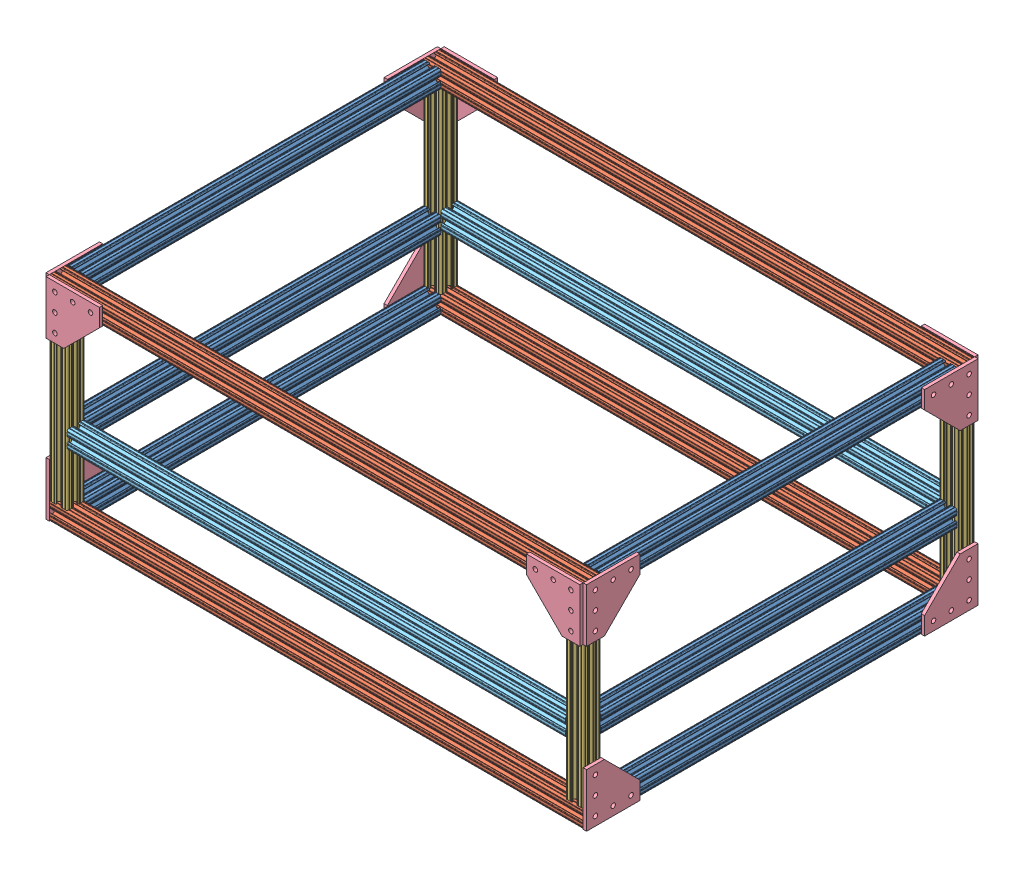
SolidWorks assembly Base Without Wheels.SLDASM, configuration Default (file format 9000). Lengths in mm.
Overall size (771.55 304.8 568.35).
28 component instances, 5 part files, 77 mates.
Components (placement in the parent):
- 1010 20in-2: 1010 20in.SLDPRT [Default] at (231.3281 508 268.5426) size (25.4 25.4 508)
- 1010 30in-1: 1010 30in.SLDPRT [Default] at (-517.9719 508 281.2426) x (0 0 1) z (-1 0 0) size (25.4 25.4 762)
- 1010 30in-2: 1010 30in.SLDPRT [Default] at (-517.9719 508 -252.1574) x (0 0 1) z (-1 0 0) size (25.4 25.4 762)
- 1010 20in-3: 1010 20in.SLDPRT [Default] at (-505.2719 508 268.5426) size (25.4 25.4 508)
- 1010 10in-1: 1010 10in.SLDPRT [Default] at (231.3281 520.7 281.2426) x (1 0 0) z (0 -1 0) size (25.4 25.4 254)
- 1010 10in-2: 1010 10in.SLDPRT [Default] at (231.3281 520.7 -252.1574) x (1 0 0) z (0 -1 0) size (25.4 25.4 254)
- 1010 10in-3: 1010 10in.SLDPRT [Default] at (-505.2719 520.7 -252.1574) x (1 0 0) z (0 -1 0) size (25.4 25.4 254)
- 1010 10in-4: 1010 10in.SLDPRT [Default] at (-505.2719 520.7 281.2426) x (1 0 0) z (0 -1 0) size (25.4 25.4 254)
- 1010 30in-3: 1010 30in.SLDPRT [Default] at (244.0281 787.4 -252.1574) x (0 0 -1) z (1 0 0) size (25.4 25.4 762)
- 1010 20in-4: 1010 20in.SLDPRT [Default] at (231.3281 787.4 268.5426) size (25.4 25.4 508)
- 1010 30in-4: 1010 30in.SLDPRT [Default] at (-517.9719 787.4 281.2426) x (0 -1 0) z (-1 0 0) size (25.4 25.4 762)
- 1010 20in-5: 1010 20in.SLDPRT [Default] at (-505.2719 787.4 268.5426) size (25.4 25.4 508)
- 4151-1: 4151.sldprt [Default] at (248.8033 495.3 255.8426) x (0 0 1) z (-1 0 0) size (76.2 76.2 4.78)
- 4151-2: 4151.sldprt [Default] at (244.0281 495.3 -226.7574) x (0 0 -1) z (1 0 0) size (76.2 76.2 4.78)
- 4151-3: 4151.sldprt [Default] at (-522.7471 533.4 293.9426) x (0 -1 0) z (1 0 0) size (76.2 76.2 4.78)
- 4151-4: 4151.sldprt [Default] at (-522.7471 495.3 -226.7574) x (0 0 -1) z (1 0 0) size (76.2 76.2 4.78)
- 4151-5: 4151.sldprt [Default] at (248.8033 800.1 -226.7574) x (0 0 -1) z (-1 0 0) size (76.2 76.2 4.78)
- 4151-6: 4151.sldprt [Default] at (248.8033 762 293.9426) x (0 1 0) z (-1 0 0) size (76.2 76.2 4.78)
- 4151-7: 4151.sldprt [Default] at (244.0281 762 293.9426) x (0 1 0) z (0 0 1) size (76.2 76.2 4.78)
- 4151-8: 4151.sldprt [Default] at (244.0281 762 -269.6326) x (0 1 0) z (0 0 1) size (76.2 76.2 4.78)
- 4151-9: 4151.sldprt [Default] at (-522.7471 762 -264.8574) x (0 1 0) z (1 0 0) size (76.2 76.2 4.78)
- 4151-10: 4151.sldprt [Default] at (-522.7471 800.1 255.8426) x (0 0 1) z (1 0 0) size (76.2 76.2 4.78)
- 4151-11: 4151.sldprt [Default] at (-517.9719 762 298.7178) x (0 1 0) z (0 0 -1) size (76.2 76.2 4.78)
- 4151-12: 4151.sldprt [Default] at (-517.9719 762 -264.8574) x (0 1 0) z (0 0 -1) size (76.2 76.2 4.78)
- 1010 28in-1: 1010 28in.SLDPRT [Default] at (-492.5719 608.8386 281.2426) x (0 0 1) z (-1 0 0) size (25.4 25.4 711.2)
- 1010 28in-2: 1010 28in.SLDPRT [Default] at (-492.5719 612.9856 -252.1574) x (0 0 1) z (-1 0 0) size (25.4 25.4 711.2)
- 1010 20in-6: 1010 20in.SLDPRT [Default] at (231.3281 612.74 268.5426) size (25.4 25.4 508)
- 1010 20in-7: 1010 20in.SLDPRT [Default] at (-505.2719 606.9045 268.5426) size (25.4 25.4 508)
Mates (geometry in assembly coordinates):
- Coincident5: coincident aligned: plane of 1010 20in-2 through (244.0281 514.3331 -239.4574) normal (1 0 0); plane of 1010 30in-1 through (244.0281 500.3292 279.5333) normal (1 0 0)
- Coincident6: coincident anti-aligned: plane of 1010 20in-2 through (229.6188 500.3292 268.5426) normal (0 0 1); plane of 1010 30in-1 through (244.0281 498.4496 268.5426) normal (0 0 -1)
- Coincident7: coincident aligned: plane of 1010 20in-2 through (221.7776 520.7 -239.4574) normal (0 1 0); plane of 1010 30in-1 through (244.0281 520.7 271.6921) normal (0 1 0)
- Coincident8: coincident anti-aligned: plane of 1010 20in-2 through (229.6188 500.3292 -239.4574) normal (0 0 -1); plane of 1010 30in-2 through (244.0281 514.3331 -239.4574) normal (0 0 1)
- Coincident9: coincident aligned: plane of 1010 20in-2 through (244.0281 514.3331 -239.4574) normal (1 0 0); plane of 1010 30in-2 through (244.0281 500.3292 -253.8667) normal (1 0 0)
- Coincident10: coincident aligned: plane of 1010 20in-2 through (221.7776 520.7 -239.4574) normal (0 1 0); plane of 1010 30in-2 through (244.0281 520.7 -242.607) normal (0 1 0)
- Coincident11: coincident anti-aligned: plane of 1010 30in-2 through (244.0281 514.3331 -239.4574) normal (0 0 1); plane of 1010 20in-3 through (-506.9812 500.3292 -239.4574) normal (0 0 -1)
- Coincident12: coincident aligned: plane of 1010 30in-2 through (244.0281 520.7 -242.607) normal (0 1 0); plane of 1010 20in-3 through (-514.8224 520.7 -239.4574) normal (0 1 0)
- Coincident13: coincident aligned: plane of 1010 30in-2 through (-517.9719 500.3292 -253.8667) normal (-1 0 0); plane of 1010 20in-3 through (-517.9719 514.3331 -239.4574) normal (-1 0 0)
- Coincident14: coincident anti-aligned: plane of 1010 30in-1 through (244.0281 520.7 271.6921) normal (0 1 0); plane of 1010 10in-1 through (229.6188 520.7 273.5718) normal (0 -1 0)
- Coincident15: coincident aligned: plane of 1010 30in-1 through (244.0281 500.3292 279.5333) normal (1 0 0); plane of 1010 10in-1 through (244.0281 774.7 287.5756) normal (1 0 0)
- Coincident16: coincident aligned: plane of 1010 30in-1 through (244.0281 514.3331 293.9426) normal (0 0 1); plane of 1010 10in-1 through (221.7776 774.7 293.9426) normal (0 0 1)
- Coincident17: coincident anti-aligned: plane of 1010 30in-2 through (244.0281 520.7 -261.7079) normal (0 1 0); plane of 1010 10in-2 through (229.6188 520.7 -259.8282) normal (0 -1 0)
- Coincident18: coincident aligned: plane of 1010 30in-2 through (244.0281 500.3292 -253.8667) normal (1 0 0); plane of 1010 10in-2 through (244.0281 774.7 -245.8244) normal (1 0 0)
- Coincident19: coincident aligned: plane of 1010 30in-2 through (244.0281 514.3331 -264.8574) normal (0 0 -1); plane of 1010 10in-2 through (224.9949 774.7 -264.8574) normal (0 0 -1)
- Coincident20: coincident anti-aligned: plane of 1010 30in-2 through (244.0281 520.7 -261.7079) normal (0 1 0); plane of 1010 10in-3 through (-506.9812 520.7 -259.8282) normal (0 -1 0)
- Coincident21: coincident aligned: plane of 1010 30in-2 through (-517.9719 500.3292 -253.8667) normal (-1 0 0); plane of 1010 10in-3 through (-517.9719 774.7 -261.7078) normal (-1 0 0)
- Coincident22: coincident aligned: plane of 1010 30in-2 through (244.0281 514.3331 -264.8574) normal (0 0 -1); plane of 1010 10in-3 through (-511.6051 774.7 -264.8574) normal (0 0 -1)
- Coincident23: coincident anti-aligned: plane of 1010 30in-1 through (244.0281 520.7 271.6921) normal (0 1 0); plane of 1010 10in-4 through (-506.9812 520.7 273.5718) normal (0 -1 0)
- Coincident24: coincident aligned: plane of 1010 30in-1 through (-517.9719 500.3292 279.5333) normal (-1 0 0); plane of 1010 10in-4 through (-517.9719 774.7 287.5756) normal (-1 0 0)
- Coincident25: coincident aligned: plane of 1010 30in-1 through (244.0281 514.3331 293.9426) normal (0 0 1); plane of 1010 10in-4 through (-514.8224 774.7 293.9426) normal (0 0 1)
- Coincident28: coincident anti-aligned: plane of 1010 10in-2 through (229.6188 774.7 -259.8282) normal (0 1 0); plane of 1010 30in-3 through (-517.9719 774.7 -245.8243) normal (0 -1 0)
- Coincident29: coincident aligned: plane of 1010 10in-2 through (244.0281 774.7 -261.7078) normal (1 0 0); plane of 1010 30in-3 through (244.0281 779.7292 -250.4482) normal (1 0 0)
- Coincident30: coincident aligned: plane of 1010 10in-2 through (221.7776 774.7 -239.4574) normal (0 0 1); plane of 1010 30in-3 through (-517.9719 793.7331 -239.4574) normal (0 0 1)
- Coincident31: coincident anti-aligned: plane of 1010 30in-3 through (-517.9719 793.7331 -239.4574) normal (0 0 1); plane of 1010 20in-4 through (229.6188 779.7292 -239.4574) normal (0 0 -1)
- Coincident32: coincident aligned: plane of 1010 30in-3 through (244.0281 779.7292 -250.4482) normal (1 0 0); plane of 1010 20in-4 through (244.0281 793.7331 -239.4574) normal (1 0 0)
- Coincident33: coincident aligned: plane of 1010 30in-3 through (-517.9719 800.1 -242.607) normal (0 1 0); plane of 1010 20in-4 through (221.7776 800.1 -239.4574) normal (0 1 0)
- Coincident34: coincident aligned: plane of 1010 20in-4 through (244.0281 793.7331 -239.4574) normal (1 0 0); plane of 1010 30in-4 through (244.0281 789.1093 273.5718) normal (1 0 0)
- Coincident35: coincident anti-aligned: plane of 1010 20in-4 through (229.6188 779.7292 268.5426) normal (0 0 1); plane of 1010 30in-4 through (244.0281 793.7331 268.5426) normal (0 0 -1)
- Coincident36: coincident aligned: plane of 1010 20in-4 through (221.7776 800.1 -239.4574) normal (0 1 0); plane of 1010 30in-4 through (244.0281 800.1 271.6922) normal (0 1 0)
- Coincident37: coincident anti-aligned: plane of 1010 30in-3 through (-517.9719 793.7331 -239.4574) normal (0 0 1); plane of 1010 20in-5 through (-506.9812 779.7292 -239.4574) normal (0 0 -1)
- Coincident38: coincident aligned: plane of 1010 30in-3 through (-517.9719 800.1 -242.607) normal (0 1 0); plane of 1010 20in-5 through (-514.8224 800.1 -239.4574) normal (0 1 0)
- Coincident39: coincident aligned: plane of 1010 30in-3 through (-517.9719 779.7292 -250.4482) normal (-1 0 0); plane of 1010 20in-5 through (-517.9719 777.8496 -239.4574) normal (-1 0 0)
- Coincident40: coincident aligned: plane of 1010 30in-1 through (244.0281 498.4496 293.9426) normal (0 0 1); plane of 4151-1 through (248.8033 495.3 293.9426) normal (0 0 1)
- Coincident41: coincident anti-aligned: plane of 1010 30in-1 through (244.0281 500.3292 279.5333) normal (1 0 0); plane of 4151-1 through (244.0281 495.3 255.8426) normal (-1 0 0)
- Tangent1: tangent aligned: cylinder of 1010 30in-1 through (244.0281 497.4082 291.8344) axis (-1 0 0) radius 2.1082; plane of 4151-1 through (248.8033 495.3 217.7426) normal (0 -1 0)
- Coincident42: coincident anti-aligned: plane of 1010 30in-2 through (244.0281 500.3292 -253.8667) normal (1 0 0); plane of 4151-2 through (244.0281 495.3 -226.7574) normal (-1 0 0)
- Coincident43: coincident aligned: plane of 1010 30in-2 through (244.0281 495.3 -245.8243) normal (0 -1 0); plane of 4151-2 through (244.0281 495.3 -188.6574) normal (0 -1 0)
- Coincident44: coincident aligned: plane of 1010 30in-2 through (244.0281 498.4496 -264.8574) normal (0 0 -1); plane of 4151-2 through (244.0281 495.3 -264.8574) normal (0 0 -1)
- Coincident45: coincident anti-aligned: plane of 1010 30in-1 through (-517.9719 500.3292 279.5333) normal (-1 0 0); plane of 4151-3 through (-517.9719 533.4 293.9426) normal (1 0 0)
- Coincident46: coincident aligned: plane of 1010 30in-1 through (244.0281 514.3331 293.9426) normal (0 0 1); plane of 4151-3 through (-522.7471 571.5 293.9426) normal (0 0 1)
- Coincident47: coincident aligned: plane of 1010 20in-3 through (-511.6051 495.3 -239.4574) normal (0 -1 0); plane of 4151-3 through (-522.7471 495.3 293.9426) normal (0 -1 0)
- Coincident48: coincident anti-aligned: plane of 1010 30in-2 through (-517.9719 500.3292 -253.8667) normal (-1 0 0); plane of 4151-4 through (-517.9719 495.3 -226.7574) normal (1 0 0)
- Coincident49: coincident aligned: plane of 1010 30in-2 through (244.0281 495.3 -245.8243) normal (0 -1 0); plane of 4151-4 through (-522.7471 495.3 -188.6574) normal (0 -1 0)
- Coincident50: coincident aligned: plane of 1010 10in-3 through (-511.6051 774.7 -264.8574) normal (0 0 -1); plane of 4151-4 through (-522.7471 495.3 -264.8574) normal (0 0 -1)
- Coincident51: coincident anti-aligned: plane of 1010 30in-3 through (244.0281 779.7292 -250.4482) normal (1 0 0); plane of 4151-5 through (244.0281 800.1 -226.7574) normal (-1 0 0)
- Coincident52: coincident aligned: plane of 1010 30in-3 through (-517.9719 800.1 -242.607) normal (0 1 0); plane of 4151-5 through (248.8033 800.1 -188.6574) normal (0 1 0)
- Coincident53: coincident aligned: plane of 1010 30in-3 through (-517.9719 793.7331 -264.8574) normal (0 0 -1); plane of 4151-5 through (248.8033 800.1 -264.8574) normal (0 0 -1)
- Coincident54: coincident anti-aligned: plane of 1010 30in-4 through (244.0281 789.1093 273.5718) normal (1 0 0); plane of 4151-6 through (244.0281 762 293.9426) normal (-1 0 0)
- Coincident55: coincident aligned: plane of 1010 30in-4 through (244.0281 796.9504 293.9426) normal (0 0 1); plane of 4151-6 through (248.8033 723.9 293.9426) normal (0 0 1)
- Coincident56: coincident aligned: plane of 1010 20in-4 through (240.8785 800.1 -239.4574) normal (0 1 0); plane of 4151-6 through (248.8033 800.1 293.9426) normal (0 1 0)
- Coincident57: coincident anti-aligned: plane of 1010 30in-4 through (244.0281 796.9504 293.9426) normal (0 0 1); plane of 4151-7 through (244.0281 762 293.9426) normal (0 0 -1)
- Coincident58: coincident aligned: plane of 1010 30in-4 through (244.0281 800.1 287.5756) normal (0 1 0); plane of 4151-7 through (244.0281 800.1 293.9426) normal (0 1 0)
- Coincident59: coincident: line of 4151-6 through (244.0281 723.9 293.9426) axis (0 1 0); plane of 4151-7 through (244.0281 723.9 293.9426) normal (1 0 0)
- Coincident60: coincident anti-aligned: plane of 1010 30in-3 through (-517.9719 793.7331 -264.8574) normal (0 0 -1); plane of 4151-8 through (244.0281 762 -264.8574) normal (0 0 1)
- Coincident61: coincident aligned: plane of 1010 30in-3 through (-517.9719 800.1 -261.7079) normal (0 1 0); plane of 4151-8 through (244.0281 800.1 -269.6326) normal (0 1 0)
- Coincident62: coincident: line of 4151-5 through (244.0281 800.1 -264.8574) axis (0 -1 0); plane of 4151-8 through (244.0281 723.9 -269.6326) normal (1 0 0)
- Coincident63: coincident anti-aligned: plane of 1010 30in-3 through (-517.9719 779.7292 -250.4482) normal (-1 0 0); plane of 4151-9 through (-517.9719 762 -264.8574) normal (1 0 0)
- Coincident64: coincident aligned: plane of 1010 30in-3 through (-517.9719 800.1 -242.607) normal (0 1 0); plane of 4151-9 through (-522.7471 800.1 -264.8574) normal (0 1 0)
- Coincident65: coincident aligned: plane of 1010 30in-3 through (-517.9719 793.7331 -264.8574) normal (0 0 -1); plane of 4151-9 through (-522.7471 723.9 -264.8574) normal (0 0 -1)
- Coincident66: coincident anti-aligned: plane of 1010 30in-4 through (-517.9719 789.1093 273.5718) normal (-1 0 0); plane of 4151-10 through (-517.9719 800.1 255.8426) normal (1 0 0)
- Coincident67: coincident aligned: plane of 1010 30in-4 through (244.0281 800.1 271.6922) normal (0 1 0); plane of 4151-10 through (-522.7471 800.1 217.7426) normal (0 1 0)
- Coincident68: coincident aligned: plane of 1010 30in-4 through (244.0281 796.9504 293.9426) normal (0 0 1); plane of 4151-10 through (-522.7471 800.1 293.9426) normal (0 0 1)
- Coincident69: coincident anti-aligned: plane of 1010 30in-4 through (244.0281 796.9504 293.9426) normal (0 0 1); plane of 4151-11 through (-517.9719 762 293.9426) normal (0 0 -1)
- Coincident70: coincident aligned: plane of 1010 30in-4 through (244.0281 800.1 287.5756) normal (0 1 0); plane of 4151-11 through (-517.9719 800.1 298.7178) normal (0 1 0)
- Coincident71: coincident: line of 4151-10 through (-517.9719 800.1 293.9426) axis (0 -1 0); plane of 4151-11 through (-517.9719 723.9 298.7178) normal (-1 0 0)
- Coincident72: coincident anti-aligned: plane of 1010 30in-3 through (-517.9719 793.7331 -264.8574) normal (0 0 -1); plane of 4151-12 through (-517.9719 762 -264.8574) normal (0 0 1)
- Coincident73: coincident aligned: plane of 1010 30in-3 through (-517.9719 800.1 -261.7079) normal (0 1 0); plane of 4151-12 through (-517.9719 800.1 -264.8574) normal (0 1 0)
- Coincident74: coincident: line of 4151-9 through (-517.9719 723.9 -264.8574) axis (0 1 0); plane of 4151-12 through (-517.9719 723.9 -264.8574) normal (-1 0 0)
- Coincident75: coincident anti-aligned: plane of 1010 10in-1 through (218.6281 774.7 271.6922) normal (-1 0 0); plane of 1010 28in-1 through (218.6281 601.1678 279.5333) normal (1 0 0)
- Coincident76: coincident anti-aligned: plane of 1010 10in-2 through (218.6281 774.7 -261.7078) normal (-1 0 0); plane of 1010 28in-2 through (218.6281 605.3148 -253.8667) normal (1 0 0)
- Coincident77: coincident aligned: plane of 1010 10in-2 through (224.9949 774.7 -264.8574) normal (0 0 -1); plane of 1010 28in-2 through (218.6281 619.3187 -264.8574) normal (0 0 -1)
- Coincident78: coincident aligned: plane of 1010 10in-1 through (221.7776 774.7 293.9426) normal (0 0 1); plane of 1010 28in-1 through (218.6281 615.1717 293.9426) normal (0 0 1)
- Coincident79: coincident anti-aligned: plane of 1010 10in-2 through (240.8785 774.7 -239.4574) normal (0 0 1); plane of 1010 20in-6 through (229.6188 605.0692 -239.4574) normal (0 0 -1)
- Coincident80: coincident aligned: plane of 1010 10in-2 through (244.0281 774.7 -245.8244) normal (1 0 0); plane of 1010 20in-6 through (244.0281 619.0731 -239.4574) normal (1 0 0)
- Coincident81: coincident anti-aligned: plane of 1010 10in-3 through (-514.8224 774.7 -239.4574) normal (0 0 1); plane of 1010 20in-7 through (-506.9812 599.2337 -239.4574) normal (0 0 -1)
- Coincident82: coincident aligned: plane of 1010 10in-3 through (-517.9719 774.7 -245.8244) normal (-1 0 0); plane of 1010 20in-7 through (-517.9719 613.2376 -239.4574) normal (-1 0 0)
